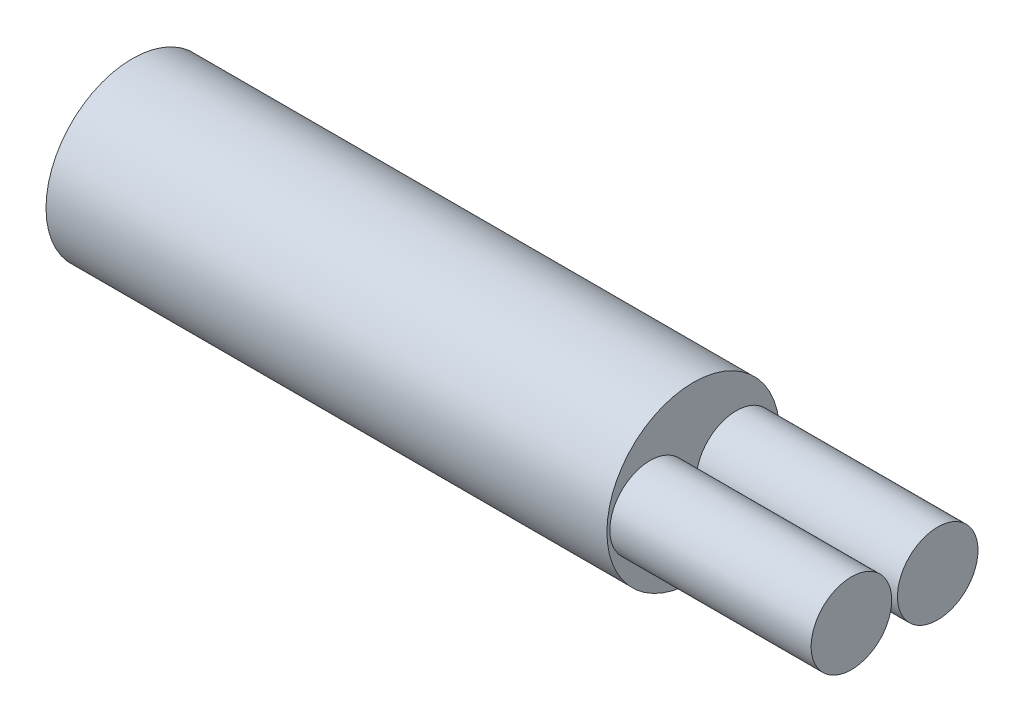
ISO-10303-21;
HEADER;
FILE_DESCRIPTION(('STEP AP214'),'2;1');
FILE_NAME('part.step','',(''),(''),'','','');
FILE_SCHEMA(('AUTOMOTIVE_DESIGN { 1 0 10303 214 1 1 1 1 }'));
ENDSEC;
DATA;
#1=APPLICATION_CONTEXT('core data for automotive mechanical design processes');
#2=APPLICATION_PROTOCOL_DEFINITION('international standard','automotive_design',2000,#1);
#3=PRODUCT_CONTEXT('',#1,'mechanical');
#4=PRODUCT('Part','Part','',(#3));
#5=PRODUCT_RELATED_PRODUCT_CATEGORY('part','',(#4));
#6=PRODUCT_DEFINITION_FORMATION('','',#4);
#7=PRODUCT_DEFINITION_CONTEXT('part definition',#1,'design');
#8=PRODUCT_DEFINITION('design','',#6,#7);
#9=PRODUCT_DEFINITION_SHAPE('','',#8);
#10=(LENGTH_UNIT() NAMED_UNIT(*) SI_UNIT(.MILLI.,.METRE.));
#11=(NAMED_UNIT(*) PLANE_ANGLE_UNIT() SI_UNIT($,.RADIAN.));
#12=(NAMED_UNIT(*) SI_UNIT($,.STERADIAN.) SOLID_ANGLE_UNIT());
#13=UNCERTAINTY_MEASURE_WITH_UNIT(LENGTH_MEASURE(1.E-05),#10,'distance_accuracy_value','');
#14=(GEOMETRIC_REPRESENTATION_CONTEXT(3) GLOBAL_UNCERTAINTY_ASSIGNED_CONTEXT((#13)) GLOBAL_UNIT_ASSIGNED_CONTEXT((#10,
#11,#12)) REPRESENTATION_CONTEXT('',''));
#15=CARTESIAN_POINT('',(0.,0.,0.));
#16=DIRECTION('',(0.,0.,1.));
#17=DIRECTION('',(1.,0.,0.));
#18=AXIS2_PLACEMENT_3D('',#15,#16,#17);
#19=CARTESIAN_POINT('',(-19.5,0.,0.));
#20=DIRECTION('',(1.,0.,0.));
#21=DIRECTION('',(0.,0.,-1.));
#22=AXIS2_PLACEMENT_3D('',#19,#20,#21);
#23=CYLINDRICAL_SURFACE('',#22,3.);
#24=CARTESIAN_POINT('',(-19.5,0.,0.));
#25=DIRECTION('',(1.,0.,0.));
#26=DIRECTION('',(0.,0.,-1.));
#27=AXIS2_PLACEMENT_3D('',#24,#25,#26);
#28=CIRCLE('',#27,3.);
#29=CARTESIAN_POINT('',(-19.5,0.,-3.));
#30=VERTEX_POINT('',#29);
#31=EDGE_CURVE('E41',#30,#30,#28,.T.);
#32=ORIENTED_EDGE('',*,*,#31,.T.);
#33=EDGE_LOOP('',(#32));
#34=FACE_BOUND('',#33,.T.);
#35=CARTESIAN_POINT('',(0.,0.,0.));
#36=DIRECTION('',(1.,0.,0.));
#37=DIRECTION('',(0.,0.,-1.));
#38=AXIS2_PLACEMENT_3D('',#35,#36,#37);
#39=CIRCLE('',#38,3.);
#40=CARTESIAN_POINT('',(0.,0.,-3.));
#41=VERTEX_POINT('',#40);
#42=EDGE_CURVE('E37',#41,#41,#39,.T.);
#43=ORIENTED_EDGE('',*,*,#42,.F.);
#44=EDGE_LOOP('',(#43));
#45=FACE_BOUND('',#44,.T.);
#46=ADVANCED_FACE('F34',(#34,#45),#23,.T.);
#47=CARTESIAN_POINT('',(-19.5,0.,0.));
#48=DIRECTION('',(1.,0.,0.));
#49=DIRECTION('',(0.,0.,-1.));
#50=AXIS2_PLACEMENT_3D('',#47,#48,#49);
#51=PLANE('',#50);
#52=ORIENTED_EDGE('',*,*,#31,.F.);
#53=EDGE_LOOP('',(#52));
#54=FACE_BOUND('',#53,.T.);
#55=ADVANCED_FACE('F70',(#54),#51,.F.);
#56=CARTESIAN_POINT('',(0.,0.,0.));
#57=DIRECTION('',(1.,0.,0.));
#58=DIRECTION('',(0.,0.,-1.));
#59=AXIS2_PLACEMENT_3D('',#56,#57,#58);
#60=PLANE('',#59);
#61=CARTESIAN_POINT('',(0.,0.,-1.5));
#62=DIRECTION('',(1.,0.,0.));
#63=DIRECTION('',(0.,0.,-1.));
#64=AXIS2_PLACEMENT_3D('',#61,#62,#63);
#65=CIRCLE('',#64,1.4);
#66=CARTESIAN_POINT('',(0.,0.,-2.9));
#67=VERTEX_POINT('',#66);
#68=EDGE_CURVE('E51',#67,#67,#65,.T.);
#69=ORIENTED_EDGE('',*,*,#68,.F.);
#70=EDGE_LOOP('',(#69));
#71=FACE_BOUND('',#70,.T.);
#72=CARTESIAN_POINT('',(0.,0.,1.5));
#73=DIRECTION('',(1.,0.,0.));
#74=DIRECTION('',(0.,0.,-1.));
#75=AXIS2_PLACEMENT_3D('',#72,#73,#74);
#76=CIRCLE('',#75,1.4);
#77=CARTESIAN_POINT('',(0.,0.,0.1));
#78=VERTEX_POINT('',#77);
#79=EDGE_CURVE('E10',#78,#78,#76,.T.);
#80=ORIENTED_EDGE('',*,*,#79,.F.);
#81=EDGE_LOOP('',(#80));
#82=FACE_BOUND('',#81,.T.);
#83=ORIENTED_EDGE('',*,*,#42,.T.);
#84=EDGE_LOOP('',(#83));
#85=FACE_BOUND('',#84,.T.);
#86=ADVANCED_FACE('F66',(#71,#82,#85),#60,.T.);
#87=CARTESIAN_POINT('',(7.,0.,1.5));
#88=DIRECTION('',(-1.,0.,0.));
#89=DIRECTION('',(0.,0.,1.));
#90=AXIS2_PLACEMENT_3D('',#87,#88,#89);
#91=CYLINDRICAL_SURFACE('',#90,1.4);
#92=CARTESIAN_POINT('',(7.,0.,1.5));
#93=DIRECTION('',(1.,0.,0.));
#94=DIRECTION('',(0.,0.,-1.));
#95=AXIS2_PLACEMENT_3D('',#92,#93,#94);
#96=CIRCLE('',#95,1.4);
#97=CARTESIAN_POINT('',(7.,0.,0.1));
#98=VERTEX_POINT('',#97);
#99=EDGE_CURVE('E47',#98,#98,#96,.T.);
#100=ORIENTED_EDGE('',*,*,#99,.F.);
#101=EDGE_LOOP('',(#100));
#102=FACE_BOUND('',#101,.T.);
#103=ORIENTED_EDGE('',*,*,#79,.T.);
#104=EDGE_LOOP('',(#103));
#105=FACE_BOUND('',#104,.T.);
#106=ADVANCED_FACE('F69',(#102,#105),#91,.T.);
#107=CARTESIAN_POINT('',(7.,0.,1.5));
#108=DIRECTION('',(1.,0.,0.));
#109=DIRECTION('',(0.,0.,-1.));
#110=AXIS2_PLACEMENT_3D('',#107,#108,#109);
#111=PLANE('',#110);
#112=ORIENTED_EDGE('',*,*,#99,.T.);
#113=EDGE_LOOP('',(#112));
#114=FACE_BOUND('',#113,.T.);
#115=ADVANCED_FACE('F62',(#114),#111,.T.);
#116=CARTESIAN_POINT('',(7.,0.,-1.5));
#117=DIRECTION('',(-1.,0.,0.));
#118=DIRECTION('',(0.,0.,1.));
#119=AXIS2_PLACEMENT_3D('',#116,#117,#118);
#120=CYLINDRICAL_SURFACE('',#119,1.4);
#121=CARTESIAN_POINT('',(7.,0.,-1.5));
#122=DIRECTION('',(1.,0.,0.));
#123=DIRECTION('',(0.,0.,-1.));
#124=AXIS2_PLACEMENT_3D('',#121,#122,#123);
#125=CIRCLE('',#124,1.4);
#126=CARTESIAN_POINT('',(7.,0.,-2.9));
#127=VERTEX_POINT('',#126);
#128=EDGE_CURVE('E50',#127,#127,#125,.T.);
#129=ORIENTED_EDGE('',*,*,#128,.F.);
#130=EDGE_LOOP('',(#129));
#131=FACE_BOUND('',#130,.T.);
#132=ORIENTED_EDGE('',*,*,#68,.T.);
#133=EDGE_LOOP('',(#132));
#134=FACE_BOUND('',#133,.T.);
#135=ADVANCED_FACE('F59',(#131,#134),#120,.T.);
#136=CARTESIAN_POINT('',(7.,0.,-1.5));
#137=DIRECTION('',(1.,0.,0.));
#138=DIRECTION('',(0.,0.,-1.));
#139=AXIS2_PLACEMENT_3D('',#136,#137,#138);
#140=PLANE('',#139);
#141=ORIENTED_EDGE('',*,*,#128,.T.);
#142=EDGE_LOOP('',(#141));
#143=FACE_BOUND('',#142,.T.);
#144=ADVANCED_FACE('F57',(#143),#140,.T.);
#145=CLOSED_SHELL('',(#46,#55,#86,#106,#115,#135,#144));
#146=MANIFOLD_SOLID_BREP('B2',#145);
#147=ADVANCED_BREP_SHAPE_REPRESENTATION('',(#18,#146),#14);
#148=SHAPE_DEFINITION_REPRESENTATION(#9,#147);
ENDSEC;
END-ISO-10303-21;
